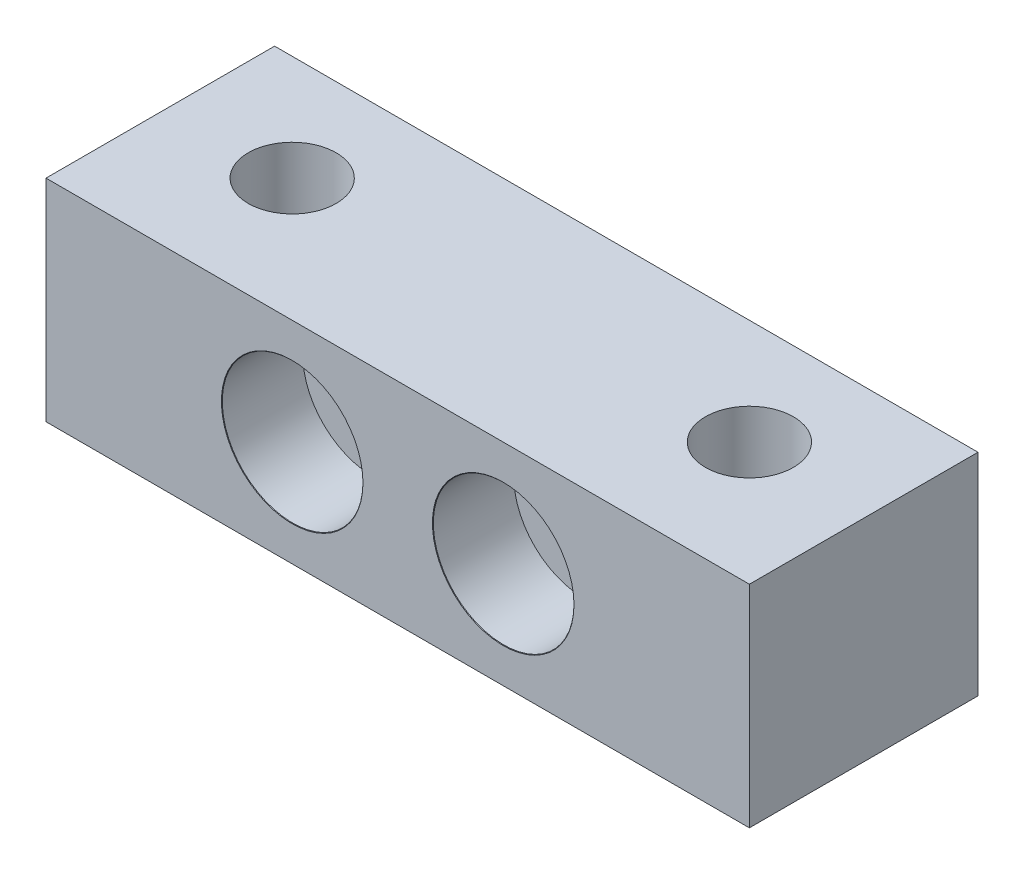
ISO-10303-21;
HEADER;
FILE_DESCRIPTION(('STEP AP214'),'2;1');
FILE_NAME('part.step','',(''),(''),'','','');
FILE_SCHEMA(('AUTOMOTIVE_DESIGN { 1 0 10303 214 1 1 1 1 }'));
ENDSEC;
DATA;
#1=APPLICATION_CONTEXT('core data for automotive mechanical design processes');
#2=APPLICATION_PROTOCOL_DEFINITION('international standard','automotive_design',2000,#1);
#3=PRODUCT_CONTEXT('',#1,'mechanical');
#4=PRODUCT('Part','Part','',(#3));
#5=PRODUCT_RELATED_PRODUCT_CATEGORY('part','',(#4));
#6=PRODUCT_DEFINITION_FORMATION('','',#4);
#7=PRODUCT_DEFINITION_CONTEXT('part definition',#1,'design');
#8=PRODUCT_DEFINITION('design','',#6,#7);
#9=PRODUCT_DEFINITION_SHAPE('','',#8);
#10=(LENGTH_UNIT() NAMED_UNIT(*) SI_UNIT(.MILLI.,.METRE.));
#11=(NAMED_UNIT(*) PLANE_ANGLE_UNIT() SI_UNIT($,.RADIAN.));
#12=(NAMED_UNIT(*) SI_UNIT($,.STERADIAN.) SOLID_ANGLE_UNIT());
#13=UNCERTAINTY_MEASURE_WITH_UNIT(LENGTH_MEASURE(1.E-05),#10,'distance_accuracy_value','');
#14=(GEOMETRIC_REPRESENTATION_CONTEXT(3) GLOBAL_UNCERTAINTY_ASSIGNED_CONTEXT((#13)) GLOBAL_UNIT_ASSIGNED_CONTEXT((#10,
#11,#12)) REPRESENTATION_CONTEXT('',''));
#15=CARTESIAN_POINT('',(0.,0.,0.));
#16=DIRECTION('',(0.,0.,1.));
#17=DIRECTION('',(1.,0.,0.));
#18=AXIS2_PLACEMENT_3D('',#15,#16,#17);
#19=CARTESIAN_POINT('',(8.78292971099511,39.855938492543,13.));
#20=DIRECTION('',(1.,0.,0.));
#21=DIRECTION('',(0.,0.,-1.));
#22=AXIS2_PLACEMENT_3D('',#19,#20,#21);
#23=PLANE('',#22);
#24=DIRECTION('',(0.,-1.,0.));
#25=VECTOR('',#24,1.);
#26=CARTESIAN_POINT('',(8.78292971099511,39.855938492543,0.));
#27=LINE('',#26,#25);
#28=CARTESIAN_POINT('',(8.78292971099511,51.855938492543,0.));
#29=VERTEX_POINT('',#28);
#30=CARTESIAN_POINT('',(8.78292971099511,39.855938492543,0.));
#31=VERTEX_POINT('',#30);
#32=EDGE_CURVE('E79',#29,#31,#27,.T.);
#33=ORIENTED_EDGE('',*,*,#32,.T.);
#34=DIRECTION('',(0.,0.,-1.));
#35=VECTOR('',#34,1.);
#36=CARTESIAN_POINT('',(8.78292971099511,39.855938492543,13.));
#37=LINE('',#36,#35);
#38=CARTESIAN_POINT('',(8.78292971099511,39.855938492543,13.));
#39=VERTEX_POINT('',#38);
#40=EDGE_CURVE('E11',#39,#31,#37,.T.);
#41=ORIENTED_EDGE('',*,*,#40,.F.);
#42=DIRECTION('',(0.,-1.,0.));
#43=VECTOR('',#42,1.);
#44=CARTESIAN_POINT('',(8.78292971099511,39.855938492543,13.));
#45=LINE('',#44,#43);
#46=CARTESIAN_POINT('',(8.78292971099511,51.855938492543,13.));
#47=VERTEX_POINT('',#46);
#48=EDGE_CURVE('E67',#47,#39,#45,.T.);
#49=ORIENTED_EDGE('',*,*,#48,.F.);
#50=DIRECTION('',(0.,0.,-1.));
#51=VECTOR('',#50,1.);
#52=CARTESIAN_POINT('',(8.78292971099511,51.855938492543,13.));
#53=LINE('',#52,#51);
#54=EDGE_CURVE('E75',#47,#29,#53,.T.);
#55=ORIENTED_EDGE('',*,*,#54,.T.);
#56=EDGE_LOOP('',(#33,#41,#49,#55));
#57=FACE_BOUND('',#56,.T.);
#58=ADVANCED_FACE('F16',(#57),#23,.F.);
#59=CARTESIAN_POINT('',(8.78292971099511,39.855938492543,13.));
#60=DIRECTION('',(0.,1.,0.));
#61=DIRECTION('',(-1.,0.,0.));
#62=AXIS2_PLACEMENT_3D('',#59,#60,#61);
#63=PLANE('',#62);
#64=CARTESIAN_POINT('',(15.7829305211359,39.855938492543,5.99999982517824));
#65=DIRECTION('',(0.,1.,0.));
#66=DIRECTION('',(0.,0.,1.));
#67=AXIS2_PLACEMENT_3D('',#64,#65,#66);
#68=CIRCLE('',#67,2.5);
#69=CARTESIAN_POINT('',(15.7829305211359,39.855938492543,8.49999982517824));
#70=VERTEX_POINT('',#69);
#71=EDGE_CURVE('E98',#70,#70,#68,.T.);
#72=ORIENTED_EDGE('',*,*,#71,.T.);
#73=EDGE_LOOP('',(#72));
#74=FACE_BOUND('',#73,.T.);
#75=CARTESIAN_POINT('',(41.782930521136,39.855938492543,5.99999982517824));
#76=DIRECTION('',(0.,1.,0.));
#77=DIRECTION('',(0.,0.,1.));
#78=AXIS2_PLACEMENT_3D('',#75,#76,#77);
#79=CIRCLE('',#78,2.5);
#80=CARTESIAN_POINT('',(41.782930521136,39.855938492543,8.49999982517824));
#81=VERTEX_POINT('',#80);
#82=EDGE_CURVE('E82',#81,#81,#79,.T.);
#83=ORIENTED_EDGE('',*,*,#82,.T.);
#84=EDGE_LOOP('',(#83));
#85=FACE_BOUND('',#84,.T.);
#86=DIRECTION('',(1.,0.,0.));
#87=VECTOR('',#86,1.);
#88=CARTESIAN_POINT('',(8.78292971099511,39.855938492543,0.));
#89=LINE('',#88,#87);
#90=CARTESIAN_POINT('',(48.7829297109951,39.855938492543,0.));
#91=VERTEX_POINT('',#90);
#92=EDGE_CURVE('E71',#31,#91,#89,.T.);
#93=ORIENTED_EDGE('',*,*,#92,.T.);
#94=DIRECTION('',(0.,0.,-1.));
#95=VECTOR('',#94,1.);
#96=CARTESIAN_POINT('',(48.7829297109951,39.855938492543,13.));
#97=LINE('',#96,#95);
#98=CARTESIAN_POINT('',(48.7829297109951,39.855938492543,13.));
#99=VERTEX_POINT('',#98);
#100=EDGE_CURVE('E24',#99,#91,#97,.T.);
#101=ORIENTED_EDGE('',*,*,#100,.F.);
#102=DIRECTION('',(1.,0.,0.));
#103=VECTOR('',#102,1.);
#104=CARTESIAN_POINT('',(8.78292971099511,39.855938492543,13.));
#105=LINE('',#104,#103);
#106=EDGE_CURVE('E62',#39,#99,#105,.T.);
#107=ORIENTED_EDGE('',*,*,#106,.F.);
#108=ORIENTED_EDGE('',*,*,#40,.T.);
#109=EDGE_LOOP('',(#93,#101,#107,#108));
#110=FACE_BOUND('',#109,.T.);
#111=ADVANCED_FACE('F70',(#74,#85,#110),#63,.F.);
#112=CARTESIAN_POINT('',(48.7829297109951,39.855938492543,13.));
#113=DIRECTION('',(-1.,0.,0.));
#114=DIRECTION('',(0.,0.,1.));
#115=AXIS2_PLACEMENT_3D('',#112,#113,#114);
#116=PLANE('',#115);
#117=DIRECTION('',(0.,1.,0.));
#118=VECTOR('',#117,1.);
#119=CARTESIAN_POINT('',(48.7829297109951,39.855938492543,0.));
#120=LINE('',#119,#118);
#121=CARTESIAN_POINT('',(48.7829297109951,51.855938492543,0.));
#122=VERTEX_POINT('',#121);
#123=EDGE_CURVE('E49',#91,#122,#120,.T.);
#124=ORIENTED_EDGE('',*,*,#123,.T.);
#125=DIRECTION('',(0.,0.,-1.));
#126=VECTOR('',#125,1.);
#127=CARTESIAN_POINT('',(48.7829297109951,51.855938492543,13.));
#128=LINE('',#127,#126);
#129=CARTESIAN_POINT('',(48.7829297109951,51.855938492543,13.));
#130=VERTEX_POINT('',#129);
#131=EDGE_CURVE('E72',#130,#122,#128,.T.);
#132=ORIENTED_EDGE('',*,*,#131,.F.);
#133=DIRECTION('',(0.,1.,0.));
#134=VECTOR('',#133,1.);
#135=CARTESIAN_POINT('',(48.7829297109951,39.855938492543,13.));
#136=LINE('',#135,#134);
#137=EDGE_CURVE('E65',#99,#130,#136,.T.);
#138=ORIENTED_EDGE('',*,*,#137,.F.);
#139=ORIENTED_EDGE('',*,*,#100,.T.);
#140=EDGE_LOOP('',(#124,#132,#138,#139));
#141=FACE_BOUND('',#140,.T.);
#142=ADVANCED_FACE('F73',(#141),#116,.F.);
#143=CARTESIAN_POINT('',(8.78292971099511,51.855938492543,13.));
#144=DIRECTION('',(0.,-1.,0.));
#145=DIRECTION('',(0.,0.,-1.));
#146=AXIS2_PLACEMENT_3D('',#143,#144,#145);
#147=PLANE('',#146);
#148=CARTESIAN_POINT('',(15.7829305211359,51.855938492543,5.99999982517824));
#149=DIRECTION('',(0.,1.,0.));
#150=DIRECTION('',(0.,0.,1.));
#151=AXIS2_PLACEMENT_3D('',#148,#149,#150);
#152=CIRCLE('',#151,2.5);
#153=CARTESIAN_POINT('',(15.7829305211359,51.855938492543,8.49999982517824));
#154=VERTEX_POINT('',#153);
#155=EDGE_CURVE('E101',#154,#154,#152,.T.);
#156=ORIENTED_EDGE('',*,*,#155,.F.);
#157=EDGE_LOOP('',(#156));
#158=FACE_BOUND('',#157,.T.);
#159=CARTESIAN_POINT('',(41.782930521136,51.855938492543,5.99999982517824));
#160=DIRECTION('',(0.,1.,0.));
#161=DIRECTION('',(0.,0.,1.));
#162=AXIS2_PLACEMENT_3D('',#159,#160,#161);
#163=CIRCLE('',#162,2.5);
#164=CARTESIAN_POINT('',(41.782930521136,51.855938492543,8.49999982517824));
#165=VERTEX_POINT('',#164);
#166=EDGE_CURVE('E95',#165,#165,#163,.T.);
#167=ORIENTED_EDGE('',*,*,#166,.F.);
#168=EDGE_LOOP('',(#167));
#169=FACE_BOUND('',#168,.T.);
#170=DIRECTION('',(-1.,0.,0.));
#171=VECTOR('',#170,1.);
#172=CARTESIAN_POINT('',(8.78292971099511,51.855938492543,0.));
#173=LINE('',#172,#171);
#174=EDGE_CURVE('E55',#122,#29,#173,.T.);
#175=ORIENTED_EDGE('',*,*,#174,.T.);
#176=ORIENTED_EDGE('',*,*,#54,.F.);
#177=DIRECTION('',(-1.,0.,0.));
#178=VECTOR('',#177,1.);
#179=CARTESIAN_POINT('',(8.78292971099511,51.855938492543,13.));
#180=LINE('',#179,#178);
#181=EDGE_CURVE('E32',#130,#47,#180,.T.);
#182=ORIENTED_EDGE('',*,*,#181,.F.);
#183=ORIENTED_EDGE('',*,*,#131,.T.);
#184=EDGE_LOOP('',(#175,#176,#182,#183));
#185=FACE_BOUND('',#184,.T.);
#186=ADVANCED_FACE('F87',(#158,#169,#185),#147,.F.);
#187=CARTESIAN_POINT('',(0.,0.,13.));
#188=DIRECTION('',(0.,0.,-1.));
#189=DIRECTION('',(-1.,0.,0.));
#190=AXIS2_PLACEMENT_3D('',#187,#188,#189);
#191=PLANE('',#190);
#192=CARTESIAN_POINT('',(22.7829297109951,45.855938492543,13.));
#193=DIRECTION('',(0.,0.,1.));
#194=DIRECTION('',(1.,0.,0.));
#195=AXIS2_PLACEMENT_3D('',#192,#193,#194);
#196=CIRCLE('',#195,4.025);
#197=CARTESIAN_POINT('',(26.8079297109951,45.855938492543,13.));
#198=VERTEX_POINT('',#197);
#199=EDGE_CURVE('E140',#198,#198,#196,.T.);
#200=ORIENTED_EDGE('',*,*,#199,.F.);
#201=EDGE_LOOP('',(#200));
#202=FACE_BOUND('',#201,.T.);
#203=CARTESIAN_POINT('',(34.7829297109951,45.855938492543,13.));
#204=DIRECTION('',(0.,0.,1.));
#205=DIRECTION('',(1.,0.,0.));
#206=AXIS2_PLACEMENT_3D('',#203,#204,#205);
#207=CIRCLE('',#206,4.025);
#208=CARTESIAN_POINT('',(38.8079297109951,45.855938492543,13.));
#209=VERTEX_POINT('',#208);
#210=EDGE_CURVE('E119',#209,#209,#207,.T.);
#211=ORIENTED_EDGE('',*,*,#210,.F.);
#212=EDGE_LOOP('',(#211));
#213=FACE_BOUND('',#212,.T.);
#214=ORIENTED_EDGE('',*,*,#48,.T.);
#215=ORIENTED_EDGE('',*,*,#106,.T.);
#216=ORIENTED_EDGE('',*,*,#137,.T.);
#217=ORIENTED_EDGE('',*,*,#181,.T.);
#218=EDGE_LOOP('',(#214,#215,#216,#217));
#219=FACE_BOUND('',#218,.T.);
#220=ADVANCED_FACE('F63',(#202,#213,#219),#191,.F.);
#221=CARTESIAN_POINT('',(0.,0.,0.));
#222=DIRECTION('',(0.,0.,-1.));
#223=DIRECTION('',(-1.,0.,0.));
#224=AXIS2_PLACEMENT_3D('',#221,#222,#223);
#225=PLANE('',#224);
#226=CARTESIAN_POINT('',(22.7829297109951,45.855938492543,0.));
#227=DIRECTION('',(0.,0.,1.));
#228=DIRECTION('',(1.,0.,0.));
#229=AXIS2_PLACEMENT_3D('',#226,#227,#228);
#230=CIRCLE('',#229,2.275);
#231=CARTESIAN_POINT('',(25.0579297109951,45.855938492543,0.));
#232=VERTEX_POINT('',#231);
#233=EDGE_CURVE('E143',#232,#232,#230,.T.);
#234=ORIENTED_EDGE('',*,*,#233,.T.);
#235=EDGE_LOOP('',(#234));
#236=FACE_BOUND('',#235,.T.);
#237=CARTESIAN_POINT('',(34.7829297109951,45.855938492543,0.));
#238=DIRECTION('',(0.,0.,1.));
#239=DIRECTION('',(1.,0.,0.));
#240=AXIS2_PLACEMENT_3D('',#237,#238,#239);
#241=CIRCLE('',#240,2.275);
#242=CARTESIAN_POINT('',(37.0579297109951,45.855938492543,0.));
#243=VERTEX_POINT('',#242);
#244=EDGE_CURVE('E122',#243,#243,#241,.T.);
#245=ORIENTED_EDGE('',*,*,#244,.T.);
#246=EDGE_LOOP('',(#245));
#247=FACE_BOUND('',#246,.T.);
#248=ORIENTED_EDGE('',*,*,#32,.F.);
#249=ORIENTED_EDGE('',*,*,#174,.F.);
#250=ORIENTED_EDGE('',*,*,#123,.F.);
#251=ORIENTED_EDGE('',*,*,#92,.F.);
#252=EDGE_LOOP('',(#248,#249,#250,#251));
#253=FACE_BOUND('',#252,.T.);
#254=ADVANCED_FACE('F90',(#236,#247,#253),#225,.T.);
#255=CARTESIAN_POINT('',(41.782930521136,51.855938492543,5.99999982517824));
#256=DIRECTION('',(0.,1.,0.));
#257=DIRECTION('',(0.,0.,1.));
#258=AXIS2_PLACEMENT_3D('',#255,#256,#257);
#259=CYLINDRICAL_SURFACE('',#258,2.5);
#260=ORIENTED_EDGE('',*,*,#82,.F.);
#261=EDGE_LOOP('',(#260));
#262=FACE_BOUND('',#261,.T.);
#263=ORIENTED_EDGE('',*,*,#166,.T.);
#264=EDGE_LOOP('',(#263));
#265=FACE_BOUND('',#264,.T.);
#266=ADVANCED_FACE('F221',(#262,#265),#259,.F.);
#267=CARTESIAN_POINT('',(15.7829305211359,51.855938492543,5.99999982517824));
#268=DIRECTION('',(0.,1.,0.));
#269=DIRECTION('',(0.,0.,1.));
#270=AXIS2_PLACEMENT_3D('',#267,#268,#269);
#271=CYLINDRICAL_SURFACE('',#270,2.5);
#272=ORIENTED_EDGE('',*,*,#71,.F.);
#273=EDGE_LOOP('',(#272));
#274=FACE_BOUND('',#273,.T.);
#275=ORIENTED_EDGE('',*,*,#155,.T.);
#276=EDGE_LOOP('',(#275));
#277=FACE_BOUND('',#276,.T.);
#278=ADVANCED_FACE('F225',(#274,#277),#271,.F.);
#279=CARTESIAN_POINT('',(34.7829297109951,45.855938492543,0.0250000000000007));
#280=DIRECTION('',(0.,0.,-1.));
#281=DIRECTION('',(-1.,0.,0.));
#282=AXIS2_PLACEMENT_3D('',#279,#280,#281);
#283=CONICAL_SURFACE('',#282,2.25,0.785398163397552);
#284=ORIENTED_EDGE('',*,*,#244,.F.);
#285=EDGE_LOOP('',(#284));
#286=FACE_BOUND('',#285,.T.);
#287=CARTESIAN_POINT('',(34.7829297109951,45.855938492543,0.0250000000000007));
#288=DIRECTION('',(0.,0.,1.));
#289=DIRECTION('',(1.,0.,0.));
#290=AXIS2_PLACEMENT_3D('',#287,#288,#289);
#291=CIRCLE('',#290,2.25);
#292=CARTESIAN_POINT('',(37.0329297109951,45.855938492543,0.0250000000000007));
#293=VERTEX_POINT('',#292);
#294=EDGE_CURVE('E104',#293,#293,#291,.T.);
#295=ORIENTED_EDGE('',*,*,#294,.T.);
#296=EDGE_LOOP('',(#295));
#297=FACE_BOUND('',#296,.T.);
#298=ADVANCED_FACE('F229',(#286,#297),#283,.F.);
#299=CARTESIAN_POINT('',(34.7829297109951,45.855938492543,13.));
#300=DIRECTION('',(0.,0.,1.));
#301=DIRECTION('',(1.,0.,0.));
#302=AXIS2_PLACEMENT_3D('',#299,#300,#301);
#303=CYLINDRICAL_SURFACE('',#302,2.25);
#304=ORIENTED_EDGE('',*,*,#294,.F.);
#305=EDGE_LOOP('',(#304));
#306=FACE_BOUND('',#305,.T.);
#307=CARTESIAN_POINT('',(34.7829297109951,45.855938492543,8.375));
#308=DIRECTION('',(0.,0.,1.));
#309=DIRECTION('',(1.,0.,0.));
#310=AXIS2_PLACEMENT_3D('',#307,#308,#309);
#311=CIRCLE('',#310,2.25);
#312=CARTESIAN_POINT('',(37.0329297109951,45.855938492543,8.375));
#313=VERTEX_POINT('',#312);
#314=EDGE_CURVE('E107',#313,#313,#311,.T.);
#315=ORIENTED_EDGE('',*,*,#314,.T.);
#316=EDGE_LOOP('',(#315));
#317=FACE_BOUND('',#316,.T.);
#318=ADVANCED_FACE('F233',(#306,#317),#303,.F.);
#319=CARTESIAN_POINT('',(34.7829297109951,45.855938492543,8.4));
#320=DIRECTION('',(0.,0.,1.));
#321=DIRECTION('',(1.,0.,0.));
#322=AXIS2_PLACEMENT_3D('',#319,#320,#321);
#323=CONICAL_SURFACE('',#322,2.275,0.785398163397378);
#324=ORIENTED_EDGE('',*,*,#314,.F.);
#325=EDGE_LOOP('',(#324));
#326=FACE_BOUND('',#325,.T.);
#327=CARTESIAN_POINT('',(34.7829297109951,45.855938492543,8.4));
#328=DIRECTION('',(0.,0.,1.));
#329=DIRECTION('',(1.,0.,0.));
#330=AXIS2_PLACEMENT_3D('',#327,#328,#329);
#331=CIRCLE('',#330,2.275);
#332=CARTESIAN_POINT('',(37.0579297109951,45.855938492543,8.4));
#333=VERTEX_POINT('',#332);
#334=EDGE_CURVE('E110',#333,#333,#331,.T.);
#335=ORIENTED_EDGE('',*,*,#334,.T.);
#336=EDGE_LOOP('',(#335));
#337=FACE_BOUND('',#336,.T.);
#338=ADVANCED_FACE('F237',(#326,#337),#323,.F.);
#339=CARTESIAN_POINT('',(37.0579297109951,45.855938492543,8.4));
#340=DIRECTION('',(0.,0.,-1.));
#341=DIRECTION('',(-1.,0.,0.));
#342=AXIS2_PLACEMENT_3D('',#339,#340,#341);
#343=PLANE('',#342);
#344=ORIENTED_EDGE('',*,*,#334,.F.);
#345=EDGE_LOOP('',(#344));
#346=FACE_BOUND('',#345,.T.);
#347=CARTESIAN_POINT('',(34.7829297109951,45.855938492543,8.4));
#348=DIRECTION('',(0.,0.,1.));
#349=DIRECTION('',(1.,0.,0.));
#350=AXIS2_PLACEMENT_3D('',#347,#348,#349);
#351=CIRCLE('',#350,4.);
#352=CARTESIAN_POINT('',(38.7829297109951,45.855938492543,8.4));
#353=VERTEX_POINT('',#352);
#354=EDGE_CURVE('E113',#353,#353,#351,.T.);
#355=ORIENTED_EDGE('',*,*,#354,.T.);
#356=EDGE_LOOP('',(#355));
#357=FACE_BOUND('',#356,.T.);
#358=ADVANCED_FACE('F200',(#346,#357),#343,.F.);
#359=CARTESIAN_POINT('',(34.7829297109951,45.855938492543,13.));
#360=DIRECTION('',(0.,0.,1.));
#361=DIRECTION('',(1.,0.,0.));
#362=AXIS2_PLACEMENT_3D('',#359,#360,#361);
#363=CYLINDRICAL_SURFACE('',#362,4.);
#364=ORIENTED_EDGE('',*,*,#354,.F.);
#365=EDGE_LOOP('',(#364));
#366=FACE_BOUND('',#365,.T.);
#367=CARTESIAN_POINT('',(34.7829297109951,45.855938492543,12.975));
#368=DIRECTION('',(0.,0.,1.));
#369=DIRECTION('',(1.,0.,0.));
#370=AXIS2_PLACEMENT_3D('',#367,#368,#369);
#371=CIRCLE('',#370,4.);
#372=CARTESIAN_POINT('',(38.7829297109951,45.855938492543,12.975));
#373=VERTEX_POINT('',#372);
#374=EDGE_CURVE('E116',#373,#373,#371,.T.);
#375=ORIENTED_EDGE('',*,*,#374,.T.);
#376=EDGE_LOOP('',(#375));
#377=FACE_BOUND('',#376,.T.);
#378=ADVANCED_FACE('F192',(#366,#377),#363,.F.);
#379=CARTESIAN_POINT('',(34.7829297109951,45.855938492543,13.));
#380=DIRECTION('',(0.,0.,1.));
#381=DIRECTION('',(1.,0.,0.));
#382=AXIS2_PLACEMENT_3D('',#379,#380,#381);
#383=CONICAL_SURFACE('',#382,4.025,0.785398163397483);
#384=ORIENTED_EDGE('',*,*,#374,.F.);
#385=EDGE_LOOP('',(#384));
#386=FACE_BOUND('',#385,.T.);
#387=ORIENTED_EDGE('',*,*,#210,.T.);
#388=EDGE_LOOP('',(#387));
#389=FACE_BOUND('',#388,.T.);
#390=ADVANCED_FACE('F153',(#386,#389),#383,.F.);
#391=CARTESIAN_POINT('',(22.7829297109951,45.855938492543,0.0250000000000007));
#392=DIRECTION('',(0.,0.,-1.));
#393=DIRECTION('',(-1.,0.,0.));
#394=AXIS2_PLACEMENT_3D('',#391,#392,#393);
#395=CONICAL_SURFACE('',#394,2.25,0.785398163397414);
#396=ORIENTED_EDGE('',*,*,#233,.F.);
#397=EDGE_LOOP('',(#396));
#398=FACE_BOUND('',#397,.T.);
#399=CARTESIAN_POINT('',(22.7829297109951,45.855938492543,0.0250000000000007));
#400=DIRECTION('',(0.,0.,1.));
#401=DIRECTION('',(1.,0.,0.));
#402=AXIS2_PLACEMENT_3D('',#399,#400,#401);
#403=CIRCLE('',#402,2.25);
#404=CARTESIAN_POINT('',(25.0329297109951,45.855938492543,0.0250000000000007));
#405=VERTEX_POINT('',#404);
#406=EDGE_CURVE('E125',#405,#405,#403,.T.);
#407=ORIENTED_EDGE('',*,*,#406,.T.);
#408=EDGE_LOOP('',(#407));
#409=FACE_BOUND('',#408,.T.);
#410=ADVANCED_FACE('F149',(#398,#409),#395,.F.);
#411=CARTESIAN_POINT('',(22.7829297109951,45.855938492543,13.));
#412=DIRECTION('',(0.,0.,1.));
#413=DIRECTION('',(1.,0.,0.));
#414=AXIS2_PLACEMENT_3D('',#411,#412,#413);
#415=CYLINDRICAL_SURFACE('',#414,2.25);
#416=ORIENTED_EDGE('',*,*,#406,.F.);
#417=EDGE_LOOP('',(#416));
#418=FACE_BOUND('',#417,.T.);
#419=CARTESIAN_POINT('',(22.7829297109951,45.855938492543,8.375));
#420=DIRECTION('',(0.,0.,1.));
#421=DIRECTION('',(1.,0.,0.));
#422=AXIS2_PLACEMENT_3D('',#419,#420,#421);
#423=CIRCLE('',#422,2.25);
#424=CARTESIAN_POINT('',(25.0329297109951,45.855938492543,8.375));
#425=VERTEX_POINT('',#424);
#426=EDGE_CURVE('E128',#425,#425,#423,.T.);
#427=ORIENTED_EDGE('',*,*,#426,.T.);
#428=EDGE_LOOP('',(#427));
#429=FACE_BOUND('',#428,.T.);
#430=ADVANCED_FACE('F152',(#418,#429),#415,.F.);
#431=CARTESIAN_POINT('',(22.7829297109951,45.855938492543,8.4));
#432=DIRECTION('',(0.,0.,1.));
#433=DIRECTION('',(1.,0.,0.));
#434=AXIS2_PLACEMENT_3D('',#431,#432,#433);
#435=CONICAL_SURFACE('',#434,2.275,0.785398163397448);
#436=ORIENTED_EDGE('',*,*,#426,.F.);
#437=EDGE_LOOP('',(#436));
#438=FACE_BOUND('',#437,.T.);
#439=CARTESIAN_POINT('',(22.7829297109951,45.855938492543,8.4));
#440=DIRECTION('',(0.,0.,1.));
#441=DIRECTION('',(1.,0.,0.));
#442=AXIS2_PLACEMENT_3D('',#439,#440,#441);
#443=CIRCLE('',#442,2.275);
#444=CARTESIAN_POINT('',(25.0579297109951,45.855938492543,8.4));
#445=VERTEX_POINT('',#444);
#446=EDGE_CURVE('E131',#445,#445,#443,.T.);
#447=ORIENTED_EDGE('',*,*,#446,.T.);
#448=EDGE_LOOP('',(#447));
#449=FACE_BOUND('',#448,.T.);
#450=ADVANCED_FACE('F159',(#438,#449),#435,.F.);
#451=CARTESIAN_POINT('',(25.0579297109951,45.855938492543,8.4));
#452=DIRECTION('',(0.,0.,-1.));
#453=DIRECTION('',(-1.,0.,0.));
#454=AXIS2_PLACEMENT_3D('',#451,#452,#453);
#455=PLANE('',#454);
#456=ORIENTED_EDGE('',*,*,#446,.F.);
#457=EDGE_LOOP('',(#456));
#458=FACE_BOUND('',#457,.T.);
#459=CARTESIAN_POINT('',(22.7829297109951,45.855938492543,8.4));
#460=DIRECTION('',(0.,0.,1.));
#461=DIRECTION('',(1.,0.,0.));
#462=AXIS2_PLACEMENT_3D('',#459,#460,#461);
#463=CIRCLE('',#462,4.);
#464=CARTESIAN_POINT('',(26.7829297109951,45.855938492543,8.4));
#465=VERTEX_POINT('',#464);
#466=EDGE_CURVE('E134',#465,#465,#463,.T.);
#467=ORIENTED_EDGE('',*,*,#466,.T.);
#468=EDGE_LOOP('',(#467));
#469=FACE_BOUND('',#468,.T.);
#470=ADVANCED_FACE('F165',(#458,#469),#455,.F.);
#471=CARTESIAN_POINT('',(22.7829297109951,45.855938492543,13.));
#472=DIRECTION('',(0.,0.,1.));
#473=DIRECTION('',(1.,0.,0.));
#474=AXIS2_PLACEMENT_3D('',#471,#472,#473);
#475=CYLINDRICAL_SURFACE('',#474,4.);
#476=ORIENTED_EDGE('',*,*,#466,.F.);
#477=EDGE_LOOP('',(#476));
#478=FACE_BOUND('',#477,.T.);
#479=CARTESIAN_POINT('',(22.7829297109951,45.855938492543,12.975));
#480=DIRECTION('',(0.,0.,1.));
#481=DIRECTION('',(1.,0.,0.));
#482=AXIS2_PLACEMENT_3D('',#479,#480,#481);
#483=CIRCLE('',#482,4.);
#484=CARTESIAN_POINT('',(26.7829297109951,45.855938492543,12.975));
#485=VERTEX_POINT('',#484);
#486=EDGE_CURVE('E137',#485,#485,#483,.T.);
#487=ORIENTED_EDGE('',*,*,#486,.T.);
#488=EDGE_LOOP('',(#487));
#489=FACE_BOUND('',#488,.T.);
#490=ADVANCED_FACE('F171',(#478,#489),#475,.F.);
#491=CARTESIAN_POINT('',(22.7829297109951,45.855938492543,13.));
#492=DIRECTION('',(0.,0.,1.));
#493=DIRECTION('',(1.,0.,0.));
#494=AXIS2_PLACEMENT_3D('',#491,#492,#493);
#495=CONICAL_SURFACE('',#494,4.025,0.785398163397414);
#496=ORIENTED_EDGE('',*,*,#486,.F.);
#497=EDGE_LOOP('',(#496));
#498=FACE_BOUND('',#497,.T.);
#499=ORIENTED_EDGE('',*,*,#199,.T.);
#500=EDGE_LOOP('',(#499));
#501=FACE_BOUND('',#500,.T.);
#502=ADVANCED_FACE('F177',(#498,#501),#495,.F.);
#503=CLOSED_SHELL('',(#58,#111,#142,#186,#220,#254,#266,#278,#298,#318,#338,#358,#378,#390,#410,
#430,#450,#470,#490,#502));
#504=MANIFOLD_SOLID_BREP('B1',#503);
#505=ADVANCED_BREP_SHAPE_REPRESENTATION('',(#18,#504),#14);
#506=SHAPE_DEFINITION_REPRESENTATION(#9,#505);
ENDSEC;
END-ISO-10303-21;
